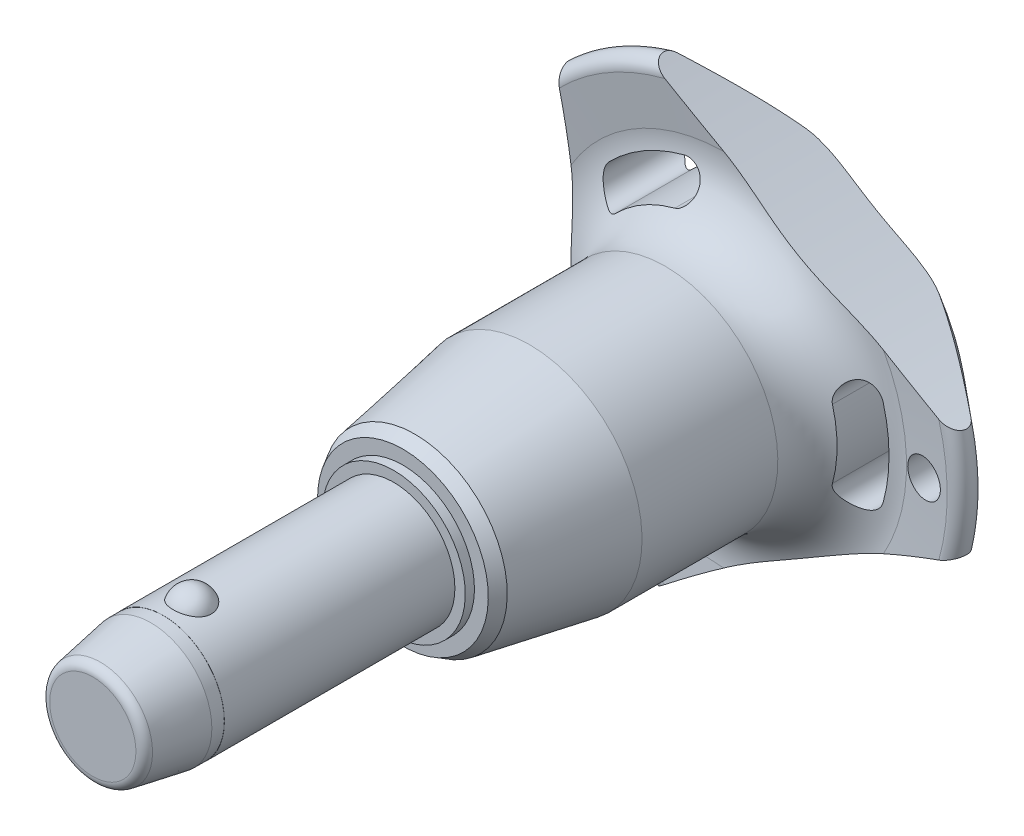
from build123d import *

# Parameters (mm, degrees)
SKETCH1_R           = 5
BOSS_EXTRUDE1_DEPTH = 15
SKETCH2_R           = 4.25
BOSS_EXTRUDE2_DEPTH = 33.3
BOSS_EXTRUDE3_START = 9.6
SKETCH1_2_R         = 5
BOSS_EXTRUDE3_DEPTH = 9.6
CHAMFER1_SIZE       = 4.8
CHAMFER1_SIZE2      = 0.846369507
FILLET1_R           = 0.75
SKETCH6_R           = 102.8
CUT_EXTRUDE1_DEPTH  = 56.691633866
CIRPATTERN1_COUNT   = 3
SKETCH7_R           = 1.5
CUT_EXTRUDE2_DEPTH  = 56.400455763
SKETCH8_R           = 5
SKETCH8_R_2         = 4.99
CUT_EXTRUDE3_DEPTH  = 5.76


with BuildPart() as part:
    # Sketch1 → Boss-Extrude1 (new body)
    with BuildSketch(Plane.XY):
        Circle(SKETCH1_R)
    extrude(amount=-BOSS_EXTRUDE1_DEPTH)

    # Sketch2 → Boss-Extrude2 (add)
    with BuildSketch(Plane(origin=(0, 0, -15), x_dir=(-1, 0, 0), z_dir=(0, 0, -1))):
        Circle(SKETCH2_R)
    extrude(amount=BOSS_EXTRUDE2_DEPTH)

    # Sketch3 → Revolve1 (revolve)
    with BuildSketch(Plane(origin=(0, 0, 0), x_dir=(0, 0, -1), z_dir=(1, 0, 0))):
        with BuildLine():
            Line((-1.516575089, 6), (-1.516575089, 2.7))
            ThreePointArc((-1.516575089, 2.7), (0.133424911, 4.35), (-1.516575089, 6))
        make_face()
        with BuildLine():
            Line((-1.516575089, -2.7), (-1.516575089, -6))
            ThreePointArc((-1.516575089, -6), (0.133424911, -4.35), (-1.516575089, -2.7))
        make_face()
    revolve(axis=Axis((0, -2.7, 1.516575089), (0, 1, 0)))

    # Sketch1_2 → Boss-Extrude3 (add)
    with BuildSketch(Plane.XY.offset(BOSS_EXTRUDE3_START)):
        Circle(SKETCH1_2_R)
    extrude(amount=-BOSS_EXTRUDE3_DEPTH)

    # Chamfer1
    chamfer1_edges = [part.edges().sort_by_distance(p)[0] for p in [
        (-5, 0, 9.6),
    ]]
    chamfer1_side = [part.faces().sort_by_distance(p)[0] for p in [
        (-5, 0, -2.7),
    ]]
    chamfer(chamfer1_edges, length=CHAMFER1_SIZE, length2=CHAMFER1_SIZE2, reference=chamfer1_side[0])

    # Fillet1
    fillet1_edges = [part.edges().sort_by_distance(p)[0] for p in [
        (-4.153630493, 0, 9.6),
        (4.25, 0, -48.3),
    ]]
    fillet(fillet1_edges, radius=FILLET1_R)

    # Sketch4 → Revolve2 (revolve)
    with BuildSketch(Plane(origin=(0, 0, 0), x_dir=(0, 0, -1), z_dir=(1, 0, 0))):
        Polygon((15, 0), (15, 5.848880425), (15.75, 5.848880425), (15.75, 6.981619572), (16.730980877, 7.547989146), (26.1, 9.2), (37.2, 9.2), (37.2, 0), align=None)
    revolve(axis=Axis((0, 0, -37.2), (0, 0, 1)))

    # Sketch5 → Revolve3 (revolve)
    with BuildSketch(Plane(origin=(0, 0, 0), x_dir=(0, 0, -1), z_dir=(1, 0, 0)), mode=Mode.PRIVATE) as revolve3_sk:
        with BuildLine():
            Line((42.169704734, 14.749576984), (41.756059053, 18.490084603))
            ThreePointArc((41.756059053, 18.490084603), (42.35677658, 19.519442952), (43.516044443, 19.24278761))
            Line((43.516044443, 19.24278761), (47.835691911, 14.094832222))
            ThreePointArc((47.835691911, 14.094832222), (48.3, 12.689260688), (47.67067517, 11.349423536))
            ThreePointArc((47.67067517, 11.349423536), (44.033110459, 6.185112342), (42.75, 0))
            Line((42.75, 0), (37.2, 0))
            Line((37.2, 0), (37.2, 9.2))
            ThreePointArc((37.2, 9.2), (40.924774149, 10.864425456), (42.169704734, 14.749576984))
        make_face()
    revolve(revolve3_sk.sketch.rotate(Axis((0, 0, -42.75), (0, 0, 1)), 90), axis=Axis((0, 0, -42.75), (0, 0, 1)))

    # Sketch6 → Cut-Extrude1 (cut, through all)
    with BuildSketch(Plane.XY):
        with Locations((-115.2, 0)):
            Circle(SKETCH6_R)
        with BuildLine():
            ThreePointArc((12.885043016, -3.538869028), (13.362182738, 0), (12.885043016, 3.538869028))
            ThreePointArc((12.885043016, 3.538869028), (11.179749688, 4.509281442), (10.209337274, 2.803988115))
            ThreePointArc((10.209337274, 2.803988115), (10.587394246, 0), (10.209337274, -2.803988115))
            ThreePointArc((10.209337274, -2.803988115), (11.179749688, -4.509281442), (12.885043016, -3.538869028))
        make_face()
    cut_extrude1 = extrude(amount=-CUT_EXTRUDE1_DEPTH, mode=Mode.SUBTRACT)

    # CirPattern1: Cut-Extrude1 ×3 about axis
    cirpattern1_axis = Axis((0, 0, 0), (0, 0, 1))
    for i in range(1, CIRPATTERN1_COUNT):
        add(cut_extrude1.rotate(cirpattern1_axis, i * 360 / CIRPATTERN1_COUNT), mode=Mode.SUBTRACT)

    # Sketch7 → Cut-Extrude2 (cut, through all)
    with BuildSketch(Plane.XY):
        with Locations(Location((16.362182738, 0, 0), (0, 0, 225.449470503))):
            Circle(SKETCH7_R)
    extrude(amount=-CUT_EXTRUDE2_DEPTH, mode=Mode.SUBTRACT)

    # Sketch8 → Cut-Extrude3 (cut)
    with BuildSketch(Plane.XY.offset(9.6)):
        Circle(SKETCH8_R)
        Circle(SKETCH8_R_2, mode=Mode.SUBTRACT)
    extrude(amount=-CUT_EXTRUDE3_DEPTH, mode=Mode.SUBTRACT)


solid = part.part
